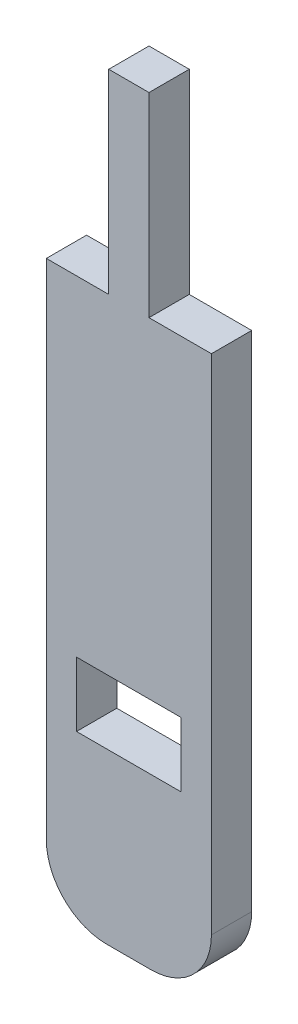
from build123d import *

# Parameters (mm, degrees)
ESQUISSE1_W        = 5.2
ESQUISSE1_H        = 3.2
ESQUISSE1_W_2      = 2
ESQUISSE1_H_2      = 9.685744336
BOSS_EXTRU_1_DEPTH = 2


with BuildPart() as part:
    # Esquisse1 → Boss.-Extru.1 (new body)
    # profile 1 of 2: a face of its own
    with BuildSketch(Plane.XY):
        with BuildLine():
            Line((-4.1, 18), (-4.1, -7))
            ThreePointArc((-4.1, -7), (-3.221320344, -9.121320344), (-1.1, -10))
            Line((-1.1, -10), (1.1, -10))
            ThreePointArc((1.1, -10), (3.221320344, -9.121320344), (4.1, -7))
            Line((4.1, -7), (4.1, 18))
            Line((4.1, 18), (-4.1, 18))
        make_face()
        Rectangle(ESQUISSE1_W, ESQUISSE1_H, mode=Mode.SUBTRACT)
    # profile 2 of 2: a face of its own
    with BuildSketch(Plane.XY):
        with Locations((0, 22.842872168)):
            Rectangle(ESQUISSE1_W_2, ESQUISSE1_H_2)
    extrude(amount=BOSS_EXTRU_1_DEPTH)


solid = part.part
